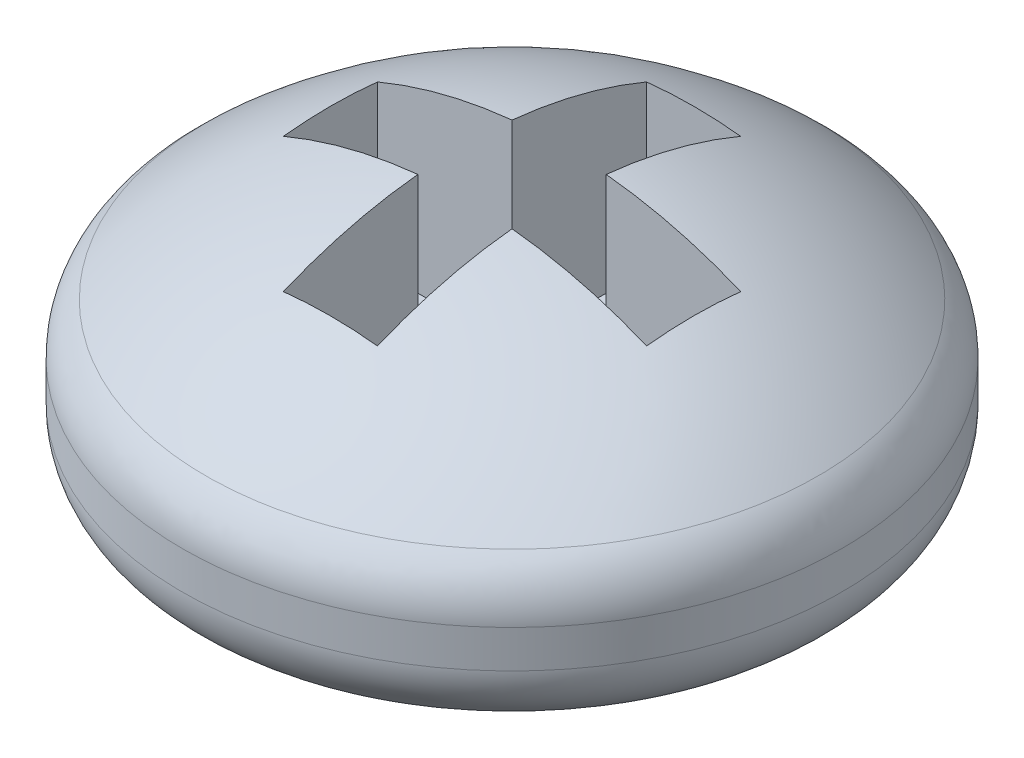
ISO-10303-21;
HEADER;
FILE_DESCRIPTION(('STEP AP214'),'2;1');
FILE_NAME('part.step','',(''),(''),'','','');
FILE_SCHEMA(('AUTOMOTIVE_DESIGN { 1 0 10303 214 1 1 1 1 }'));
ENDSEC;
DATA;
#1=APPLICATION_CONTEXT('core data for automotive mechanical design processes');
#2=APPLICATION_PROTOCOL_DEFINITION('international standard','automotive_design',2000,#1);
#3=PRODUCT_CONTEXT('',#1,'mechanical');
#4=PRODUCT('Part','Part','',(#3));
#5=PRODUCT_RELATED_PRODUCT_CATEGORY('part','',(#4));
#6=PRODUCT_DEFINITION_FORMATION('','',#4);
#7=PRODUCT_DEFINITION_CONTEXT('part definition',#1,'design');
#8=PRODUCT_DEFINITION('design','',#6,#7);
#9=PRODUCT_DEFINITION_SHAPE('','',#8);
#10=(LENGTH_UNIT() NAMED_UNIT(*) SI_UNIT(.MILLI.,.METRE.));
#11=(NAMED_UNIT(*) PLANE_ANGLE_UNIT() SI_UNIT($,.RADIAN.));
#12=(NAMED_UNIT(*) SI_UNIT($,.STERADIAN.) SOLID_ANGLE_UNIT());
#13=UNCERTAINTY_MEASURE_WITH_UNIT(LENGTH_MEASURE(1.E-05),#10,'distance_accuracy_value','');
#14=(GEOMETRIC_REPRESENTATION_CONTEXT(3) GLOBAL_UNCERTAINTY_ASSIGNED_CONTEXT((#13)) GLOBAL_UNIT_ASSIGNED_CONTEXT((#10,
#11,#12)) REPRESENTATION_CONTEXT('',''));
#15=CARTESIAN_POINT('',(0.,0.,0.));
#16=DIRECTION('',(0.,0.,1.));
#17=DIRECTION('',(1.,0.,0.));
#18=AXIS2_PLACEMENT_3D('',#15,#16,#17);
#19=CARTESIAN_POINT('',(0.,60.72875,0.));
#20=DIRECTION('',(-1.,0.,0.));
#21=DIRECTION('',(0.,0.,-1.));
#22=AXIS2_PLACEMENT_3D('',#19,#20,#21);
#23=SPHERICAL_SURFACE('',#22,3.50125);
#24=CARTESIAN_POINT('',(0.257438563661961,63.0101972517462,-2.4364370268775));
#25=CARTESIAN_POINT('',(0.257438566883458,63.2405882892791,-2.43643702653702));
#26=CARTESIAN_POINT('',(0.239035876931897,63.3902800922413,-2.26227119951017));
#27=CARTESIAN_POINT('',(0.120442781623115,63.0101972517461,-2.45091226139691));
#28=CARTESIAN_POINT('',(0.120442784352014,63.2405882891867,-2.45091226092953));
#29=CARTESIAN_POINT('',(0.111833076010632,63.3902800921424,-2.27571168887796));
#30=CARTESIAN_POINT('',(-0.0177767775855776,63.0101972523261,-2.45380548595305));
#31=CARTESIAN_POINT('',(-0.0177767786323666,63.2405882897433,-2.45380548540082));
#32=CARTESIAN_POINT('',(-0.0165060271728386,63.3902800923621,-2.27839809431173));
#33=CARTESIAN_POINT('',(-0.292739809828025,63.0101972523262,-2.43634578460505));
#34=CARTESIAN_POINT('',(-0.292739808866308,63.2405882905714,-2.43634578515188));
#35=CARTESIAN_POINT('',(-0.271813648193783,63.3902800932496,-2.26218647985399));
#36=CARTESIAN_POINT('',(-0.429483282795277,63.0101972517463,-2.4159928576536));
#37=CARTESIAN_POINT('',(-0.429483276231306,63.2405882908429,-2.41599285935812));
#38=CARTESIAN_POINT('',(-0.398782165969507,63.3902800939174,-2.24328845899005));
#39=CARTESIAN_POINT('',(-0.697612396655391,63.0101972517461,-2.35261860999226));
#40=CARTESIAN_POINT('',(-0.697612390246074,63.2405882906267,-2.35261861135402));
#41=CARTESIAN_POINT('',(-0.64774438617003,63.3902800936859,-2.18444444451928));
#42=CARTESIAN_POINT('',(-0.828998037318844,63.0101972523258,-2.30959728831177));
#43=CARTESIAN_POINT('',(-0.828998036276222,63.2405882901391,-2.30959728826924));
#44=CARTESIAN_POINT('',(-0.769738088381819,63.3902800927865,-2.14449845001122));
#45=CARTESIAN_POINT('',(-1.08268181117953,63.0101972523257,-2.20210750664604));
#46=CARTESIAN_POINT('',(-1.08268181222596,63.2405882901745,-2.20210750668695));
#47=CARTESIAN_POINT('',(-1.00528758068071,63.3902800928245,-2.04469244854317));
#48=CARTESIAN_POINT('',(-1.2049799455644,63.0101972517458,-2.13763904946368));
#49=CARTESIAN_POINT('',(-1.20497994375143,63.2405882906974,-2.13763905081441));
#50=CARTESIAN_POINT('',(-1.11884337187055,63.3902800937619,-1.98483244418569));
#51=CARTESIAN_POINT('',(-1.43701702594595,63.0101972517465,-1.98908507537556));
#52=CARTESIAN_POINT('',(-1.43701702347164,63.2405882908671,-1.98908507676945));
#53=CARTESIAN_POINT('',(-1.33429355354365,63.3902800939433,-1.84689767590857));
#54=CARTESIAN_POINT('',(-1.54675597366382,63.0101972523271,-1.90499956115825));
#55=CARTESIAN_POINT('',(-1.5467559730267,63.2405882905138,-1.90499956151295));
#56=CARTESIAN_POINT('',(-1.43618794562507,63.3902800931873,-1.76882291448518));
#57=CARTESIAN_POINT('',(-1.75055957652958,63.0101972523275,-1.71959836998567));
#58=CARTESIAN_POINT('',(-1.75055957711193,63.240588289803,-1.71959836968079));
#59=CARTESIAN_POINT('',(-1.62542289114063,63.3902800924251,-1.59667490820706));
#60=CARTESIAN_POINT('',(-1.84462422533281,63.0101972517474,-1.61828268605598));
#61=CARTESIAN_POINT('',(-1.84462422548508,63.2405882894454,-1.61828268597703));
#62=CARTESIAN_POINT('',(-1.71276343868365,63.3902800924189,-1.50260165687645));
#63=CARTESIAN_POINT('',(-2.01440898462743,63.010197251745,-1.40129719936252));
#64=CARTESIAN_POINT('',(-2.01440898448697,63.2405882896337,-1.40129719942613));
#65=CARTESIAN_POINT('',(-1.87041133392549,63.3902800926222,-1.30112712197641));
#66=CARTESIAN_POINT('',(-2.09012908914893,63.0101972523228,-1.28562739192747));
#67=CARTESIAN_POINT('',(-2.09012908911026,63.2405882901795,-1.28562739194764));
#68=CARTESIAN_POINT('',(-1.94071867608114,63.3902800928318,-1.1937258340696));
#69=CARTESIAN_POINT('',(-2.22107517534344,63.0101972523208,-1.04321734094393));
#70=CARTESIAN_POINT('',(-2.22107517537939,63.2405882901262,-1.04321734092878));
#71=CARTESIAN_POINT('',(-2.06230423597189,63.390280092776,-0.968644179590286));
#72=CARTESIAN_POINT('',(-2.27630117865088,63.0101972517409,-0.916477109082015));
#73=CARTESIAN_POINT('',(-2.27630117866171,63.2405882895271,-0.916477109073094));
#74=CARTESIAN_POINT('',(-2.1135824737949,63.3902800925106,-0.850963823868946));
#75=CARTESIAN_POINT('',(-2.36469146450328,63.0101972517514,-0.655523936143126));
#76=CARTESIAN_POINT('',(-2.36469146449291,63.2405882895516,-0.655523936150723));
#77=CARTESIAN_POINT('',(-2.19565428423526,63.39028009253,-0.608664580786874));
#78=CARTESIAN_POINT('',(-2.3978557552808,63.0101972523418,-0.521310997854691));
#79=CARTESIAN_POINT('',(-2.39785575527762,63.2405882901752,-0.521310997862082));
#80=CARTESIAN_POINT('',(-2.22644786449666,63.3902800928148,-0.484045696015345));
#81=CARTESIAN_POINT('',(-2.441181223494,63.010197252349,-0.249222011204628));
#82=CARTESIAN_POINT('',(-2.44118122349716,63.2405882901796,-0.249222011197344));
#83=CARTESIAN_POINT('',(-2.26667626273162,63.3902800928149,-0.231406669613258));
#84=CARTESIAN_POINT('',(-2.45134235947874,63.0101972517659,-0.111345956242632));
#85=CARTESIAN_POINT('',(-2.4513423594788,63.2405882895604,-0.111345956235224));
#86=CARTESIAN_POINT('',(-2.2761110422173,63.3902800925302,-0.103386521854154));
#87=CARTESIAN_POINT('',(-2.44837306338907,63.0101972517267,0.164154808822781));
#88=CARTESIAN_POINT('',(-2.44837306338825,63.2405882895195,0.164154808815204));
#89=CARTESIAN_POINT('',(-2.27335400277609,63.3902800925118,0.152420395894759));
#90=CARTESIAN_POINT('',(-2.43524267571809,63.0101972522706,0.301779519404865));
#91=CARTESIAN_POINT('',(-2.43524267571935,63.2405882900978,0.30177951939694));
#92=CARTESIAN_POINT('',(-2.26116222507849,63.3902800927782,0.280207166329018));
#93=CARTESIAN_POINT('',(-2.38606269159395,63.0101972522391,0.572871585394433));
#94=CARTESIAN_POINT('',(-2.38606269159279,63.2405882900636,0.572871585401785));
#95=CARTESIAN_POINT('',(-2.21549781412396,63.3902800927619,0.531920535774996));
#96=CARTESIAN_POINT('',(-2.35001304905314,63.0101972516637,0.706338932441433));
#97=CARTESIAN_POINT('',(-2.3500130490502,63.2405882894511,0.706338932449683));
#98=CARTESIAN_POINT('',(-2.18202513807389,63.3902800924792,0.655847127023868));
#99=CARTESIAN_POINT('',(-2.25601851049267,63.0101972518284,0.965328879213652));
#100=CARTESIAN_POINT('',(-2.25601851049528,63.2405882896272,0.965328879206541));
#101=CARTESIAN_POINT('',(-2.09474968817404,63.390280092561,0.896323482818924));
#102=CARTESIAN_POINT('',(-2.19807320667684,63.0101972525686,1.09085133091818));
#103=CARTESIAN_POINT('',(-2.19807320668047,63.2405882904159,1.09085133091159));
#104=CARTESIAN_POINT('',(-2.04094653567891,63.3902800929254,1.01287310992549));
#105=CARTESIAN_POINT('',(-2.06192931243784,63.0101972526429,1.33038358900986));
#106=CARTESIAN_POINT('',(-2.06192931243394,63.2405882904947,1.33038358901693));
#107=CARTESIAN_POINT('',(-1.9145347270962,63.3902800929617,1.23528268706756));
#108=CARTESIAN_POINT('',(-1.98373151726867,63.0101972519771,1.44439384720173));
#109=CARTESIAN_POINT('',(-1.9837315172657,63.240588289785,1.44439384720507));
#110=CARTESIAN_POINT('',(-1.84192680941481,63.3902800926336,1.34114305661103));
#111=CARTESIAN_POINT('',(-1.8093201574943,63.0101972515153,1.65766337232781));
#112=CARTESIAN_POINT('',(-1.8093201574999,63.2405882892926,1.65766337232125));
#113=CARTESIAN_POINT('',(-1.67998304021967,63.3902800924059,1.53916726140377));
#114=CARTESIAN_POINT('',(-1.71310606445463,63.0101972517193,1.75692220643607));
#115=CARTESIAN_POINT('',(-1.71310606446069,63.24058828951,1.75692220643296));
#116=CARTESIAN_POINT('',(-1.59064669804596,63.3902800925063,1.63133069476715));
#117=CARTESIAN_POINT('',(-1.50531681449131,63.010197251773,1.93790582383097));
#118=CARTESIAN_POINT('',(-1.50531681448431,63.2405882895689,1.9379058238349));
#119=CARTESIAN_POINT('',(-1.39771101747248,63.3902800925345,1.79937691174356));
#120=CARTESIAN_POINT('',(-1.39374195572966,63.0101972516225,2.01963094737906));
#121=CARTESIAN_POINT('',(-1.39374195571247,63.2405882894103,2.01963094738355));
#122=CARTESIAN_POINT('',(-1.29411195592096,63.3902800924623,1.87526001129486));
#123=CARTESIAN_POINT('',(-1.21734318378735,63.0101972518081,2.12728656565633));
#124=CARTESIAN_POINT('',(-1.21734318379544,63.240588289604,2.12728656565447));
#125=CARTESIAN_POINT('',(-1.13032284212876,63.3902800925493,1.97521999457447));
#126=CARTESIAN_POINT('',(-1.1569745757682,63.0101972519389,2.16070823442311));
#127=CARTESIAN_POINT('',(-1.15697457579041,63.2405882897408,2.16070823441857));
#128=CARTESIAN_POINT('',(-1.0742696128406,63.390280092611,2.00625255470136));
#129=CARTESIAN_POINT('',(-1.03369718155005,63.0101972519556,2.22232236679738));
#130=CARTESIAN_POINT('',(-1.03369718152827,63.2405882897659,2.2223223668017));
#131=CARTESIAN_POINT('',(-0.959804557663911,63.3902800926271,2.06346227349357));
#132=CARTESIAN_POINT('',(-0.970790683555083,63.0101972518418,2.25051941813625));
#133=CARTESIAN_POINT('',(-0.970790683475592,63.2405882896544,2.25051941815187));
#134=CARTESIAN_POINT('',(-0.901394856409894,63.3902800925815,2.08964369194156));
#135=CARTESIAN_POINT('',(-0.778924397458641,63.0101972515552,2.326943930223));
#136=CARTESIAN_POINT('',(-0.778924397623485,63.2405882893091,2.32694393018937));
#137=CARTESIAN_POINT('',(-0.723243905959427,63.3902800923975,2.16060508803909));
#138=CARTESIAN_POINT('',(-0.646621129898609,63.0101972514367,2.36712454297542));
#139=CARTESIAN_POINT('',(-0.646621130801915,63.2405882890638,2.36712454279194));
#140=CARTESIAN_POINT('',(-0.600398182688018,63.3902800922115,2.19791343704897));
#141=CARTESIAN_POINT('',(-0.427918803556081,63.0101972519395,2.41387898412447));
#142=CARTESIAN_POINT('',(-0.427918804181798,63.2405882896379,2.41387898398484));
#143=CARTESIAN_POINT('',(-0.39732953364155,63.3902800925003,2.24132569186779));
#144=CARTESIAN_POINT('',(-0.342916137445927,63.0101972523,2.42740530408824));
#145=CARTESIAN_POINT('',(-0.3429161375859,63.2405882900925,2.4274053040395));
#146=CARTESIAN_POINT('',(-0.318403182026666,63.3902800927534,2.25388509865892));
#147=CARTESIAN_POINT('',(-0.171960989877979,63.0101972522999,2.44546874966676));
#148=CARTESIAN_POINT('',(-0.171960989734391,63.2405882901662,2.44546874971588));
#149=CARTESIAN_POINT('',(-0.159668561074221,63.3902800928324,2.27065730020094));
#150=CARTESIAN_POINT('',(-0.0860085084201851,63.0101972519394,2.45000587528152));
#151=CARTESIAN_POINT('',(-0.0860085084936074,63.2405882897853,2.45000587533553));
#152=CARTESIAN_POINT('',(-0.0798602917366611,63.3902800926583,2.27487009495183));
#153=CARTESIAN_POINT('',(0.137635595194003,63.0101972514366,2.44999059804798));
#154=CARTESIAN_POINT('',(0.137635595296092,63.2405882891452,2.44999059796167));
#155=CARTESIAN_POINT('',(0.127796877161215,63.3902800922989,2.27485590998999));
#156=CARTESIAN_POINT('',(0.275414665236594,63.0101972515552,2.43834739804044));
#157=CARTESIAN_POINT('',(0.275414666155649,63.2405882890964,2.43834739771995));
#158=CARTESIAN_POINT('',(0.255726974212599,63.3902800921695,2.26404501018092));
#159=CARTESIAN_POINT('',(0.47901609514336,63.0101972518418,2.4037087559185));
#160=CARTESIAN_POINT('',(0.479016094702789,63.240588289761,2.40370875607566));
#161=CARTESIAN_POINT('',(0.444774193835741,63.3902800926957,2.23188247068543));
#162=CARTESIAN_POINT('',(0.546426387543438,63.0101972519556,2.38928122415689));
#163=CARTESIAN_POINT('',(0.546426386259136,63.2405882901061,2.38928122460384));
#164=CARTESIAN_POINT('',(0.507365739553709,63.3902800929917,2.21848627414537));
#165=CARTESIAN_POINT('',(0.679858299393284,63.0101972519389,2.35479148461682));
#166=CARTESIAN_POINT('',(0.679858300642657,63.2405882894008,2.35479148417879));
#167=CARTESIAN_POINT('',(0.63125943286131,63.3902800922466,2.18646199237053));
#168=CARTESIAN_POINT('',(0.745878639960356,63.0101972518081,2.33472431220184));
#169=CARTESIAN_POINT('',(0.745878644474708,63.2405882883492,2.33472431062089));
#170=CARTESIAN_POINT('',(0.692560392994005,63.3902800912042,2.16782929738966));
#171=CARTESIAN_POINT('',(0.94088112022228,63.0101972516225,2.26631165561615));
#172=CARTESIAN_POINT('',(0.940881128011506,63.2405882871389,2.26631165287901));
#173=CARTESIAN_POINT('',(0.873623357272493,63.3902800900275,2.10430703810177));
#174=CARTESIAN_POINT('',(1.06707192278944,63.010197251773,2.20970930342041));
#175=CARTESIAN_POINT('',(1.06707192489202,63.2405882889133,2.20970930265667));
#176=CARTESIAN_POINT('',(0.990793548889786,63.3902800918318,2.05175083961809));
#177=CARTESIAN_POINT('',(1.30809656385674,63.0101972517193,2.07614821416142));
#178=CARTESIAN_POINT('',(1.30809656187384,63.2405882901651,2.07614821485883));
#179=CARTESIAN_POINT('',(1.21458881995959,63.3902800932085,1.9277372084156));
#180=CARTESIAN_POINT('',(1.42293018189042,63.0101972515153,1.99918908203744));
#181=CARTESIAN_POINT('',(1.42293018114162,63.2405882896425,1.99918908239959));
#182=CARTESIAN_POINT('',(1.32121369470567,63.3902800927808,1.85627940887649));
#183=CARTESIAN_POINT('',(1.6380614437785,63.0101972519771,1.82707937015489));
#184=CARTESIAN_POINT('',(1.6380614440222,63.2405882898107,1.82707937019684));
#185=CARTESIAN_POINT('',(1.52096655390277,63.3902800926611,1.69647275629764));
#186=CARTESIAN_POINT('',(1.73835951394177,63.0101972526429,1.73192932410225));
#187=CARTESIAN_POINT('',(1.73835951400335,63.2405882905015,1.73192932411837));
#188=CARTESIAN_POINT('',(1.61409493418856,63.390280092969,1.60812439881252));
#189=CARTESIAN_POINT('',(1.92155700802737,63.0101972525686,1.52613928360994));
#190=CARTESIAN_POINT('',(1.92155700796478,63.2405882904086,1.52613928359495));
#191=CARTESIAN_POINT('',(1.78419677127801,63.3902800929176,1.41704501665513));
#192=CARTESIAN_POINT('',(2.00445574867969,63.0101972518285,1.41549868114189));
#193=CARTESIAN_POINT('',(2.00445574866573,63.2405882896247,1.41549868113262));
#194=CARTESIAN_POINT('',(1.86116959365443,63.3902800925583,1.31431342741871));
#195=CARTESIAN_POINT('',(2.15050111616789,63.0101972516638,1.18187180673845));
#196=CARTESIAN_POINT('',(2.15050111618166,63.240588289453,1.18187180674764));
#197=CARTESIAN_POINT('',(1.99677508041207,63.3902800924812,1.09738709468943));
#198=CARTESIAN_POINT('',(2.21364811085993,63.0101972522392,1.05888576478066));
#199=CARTESIAN_POINT('',(2.21364811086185,63.240588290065,1.05888576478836));
#200=CARTESIAN_POINT('',(2.05540808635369,63.3902800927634,0.983192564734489));
#201=CARTESIAN_POINT('',(2.31839776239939,63.0101972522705,0.804058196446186));
#202=CARTESIAN_POINT('',(2.31839776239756,63.2405882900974,0.804058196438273));
#203=CARTESIAN_POINT('',(2.15266983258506,63.3902800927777,0.746581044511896));
#204=CARTESIAN_POINT('',(2.36000046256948,63.0101972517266,0.67221668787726));
#205=CARTESIAN_POINT('',(2.36000046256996,63.2405882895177,0.672216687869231));
#206=CARTESIAN_POINT('',(2.19129861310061,63.3902800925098,0.624164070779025));
#207=CARTESIAN_POINT('',(2.4204812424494,63.0101972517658,0.403420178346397));
#208=CARTESIAN_POINT('',(2.42048124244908,63.2405882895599,0.403420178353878));
#209=CARTESIAN_POINT('',(2.24745599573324,63.3902800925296,0.374582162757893));
#210=CARTESIAN_POINT('',(2.43935927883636,63.010197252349,0.266465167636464));
#211=CARTESIAN_POINT('',(2.4393592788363,63.2405882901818,0.266465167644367));
#212=CARTESIAN_POINT('',(2.26498455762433,63.3902800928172,0.247417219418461));
#213=CARTESIAN_POINT('',(2.45385456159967,63.0101972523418,-0.0086700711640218));
#214=CARTESIAN_POINT('',(2.45385456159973,63.2405882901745,-0.00867007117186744));
#215=CARTESIAN_POINT('',(2.27844366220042,63.390280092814,-0.00805030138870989));
#216=CARTESIAN_POINT('',(2.44947184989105,63.0101972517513,-0.146850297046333));
#217=CARTESIAN_POINT('',(2.44947184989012,63.2405882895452,-0.146850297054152));
#218=CARTESIAN_POINT('',(2.27437424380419,63.3902800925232,-0.13635287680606));
#219=CARTESIAN_POINT('',(2.41757017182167,63.0101972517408,-0.420513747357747));
#220=CARTESIAN_POINT('',(2.4175701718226,63.2405882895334,-0.420513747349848));
#221=CARTESIAN_POINT('',(2.24475301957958,63.3902800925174,-0.390453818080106));
#222=CARTESIAN_POINT('',(2.39005119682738,63.0101972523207,-0.555996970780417));
#223=CARTESIAN_POINT('',(2.39005119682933,63.2405882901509,-0.555996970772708));
#224=CARTESIAN_POINT('',(2.21920120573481,63.3902800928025,-0.516252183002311));
#225=CARTESIAN_POINT('',(2.31265811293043,63.0101972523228,-0.820420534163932));
#226=CARTESIAN_POINT('',(2.31265811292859,63.2405882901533,-0.820420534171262));
#227=CARTESIAN_POINT('',(2.14734047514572,63.3902800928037,-0.761773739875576));
#228=CARTESIAN_POINT('',(2.26278398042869,63.0101972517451,-0.949360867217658));
#229=CARTESIAN_POINT('',(2.26278398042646,63.2405882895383,-0.949360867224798));
#230=CARTESIAN_POINT('',(2.10103153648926,63.3902800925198,-0.881496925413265));
#231=CARTESIAN_POINT('',(2.14209637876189,63.0101972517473,-1.19703821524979));
#232=CARTESIAN_POINT('',(2.14209637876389,63.2405882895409,-1.19703821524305));
#233=CARTESIAN_POINT('',(1.98897114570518,63.3902800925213,-1.11146935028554));
#234=CARTESIAN_POINT('',(2.07128291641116,63.0101972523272,-1.31577523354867));
#235=CARTESIAN_POINT('',(2.07128291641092,63.2405882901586,-1.31577523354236));
#236=CARTESIAN_POINT('',(1.92321969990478,63.3902800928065,-1.22171859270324));
#237=CARTESIAN_POINT('',(1.9107268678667,63.0101972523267,-1.53967535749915));
#238=CARTESIAN_POINT('',(1.9107268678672,63.2405882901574,-1.5396753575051));
#239=CARTESIAN_POINT('',(1.77414081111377,63.3902800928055,-1.4296134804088));
#240=CARTESIAN_POINT('',(1.82098428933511,63.0101972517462,-1.64483846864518));
#241=CARTESIAN_POINT('',(1.82098428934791,63.2405882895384,-1.64483846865));
#242=CARTESIAN_POINT('',(1.69081337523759,63.3902800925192,-1.52725913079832));
#243=CARTESIAN_POINT('',(1.62511750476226,63.0101972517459,-1.83860557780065));
#244=CARTESIAN_POINT('',(1.62511750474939,63.2405882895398,-1.83860557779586));
#245=CARTESIAN_POINT('',(1.50894789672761,63.390280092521,-1.70717502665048));
#246=CARTESIAN_POINT('',(1.51899329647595,63.010197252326,-1.9272095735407));
#247=CARTESIAN_POINT('',(1.51899329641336,63.2405882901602,-1.92720957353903));
#248=CARTESIAN_POINT('',(1.41040985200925,63.390280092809,-1.78944527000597));
#249=CARTESIAN_POINT('',(1.29337580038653,63.0101972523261,-2.08534323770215));
#250=CARTESIAN_POINT('',(1.29337580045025,63.2405882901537,-2.08534323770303));
#251=CARTESIAN_POINT('',(1.20092035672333,63.3902800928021,-1.93627493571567));
#252=CARTESIAN_POINT('',(1.17388251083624,63.010197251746,-2.15487290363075));
#253=CARTESIAN_POINT('',(1.17388251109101,63.2405882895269,-2.1548729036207));
#254=CARTESIAN_POINT('',(1.0899689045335,63.390280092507,-2.00083435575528));
#255=CARTESIAN_POINT('',(0.92491893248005,63.0101972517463,-2.27288414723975));
#256=CARTESIAN_POINT('',(0.924918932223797,63.2405882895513,-2.27288414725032));
#257=CARTESIAN_POINT('',(0.858802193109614,63.3902800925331,-2.11040970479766));
#258=CARTESIAN_POINT('',(0.795448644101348,63.0101972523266,-2.32136572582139));
#259=CARTESIAN_POINT('',(0.795448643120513,63.2405882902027,-2.32136572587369));
#260=CARTESIAN_POINT('',(0.738586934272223,63.3902800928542,-2.15542563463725));
#261=CARTESIAN_POINT('',(0.530206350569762,63.0101972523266,-2.39590454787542));
#262=CARTESIAN_POINT('',(0.530206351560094,63.2405882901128,-2.39590454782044));
#263=CARTESIAN_POINT('',(0.49230517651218,63.3902800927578,-2.22463613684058));
#264=CARTESIAN_POINT('',(0.394434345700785,63.0101972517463,-2.42196179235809));
#265=CARTESIAN_POINT('',(0.394434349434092,63.2405882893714,-2.42196179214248));
#266=CARTESIAN_POINT('',(0.366238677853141,63.3902800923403,-2.24883071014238));
#267=CARTESIAN_POINT('',(0.257438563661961,63.0101972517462,-2.4364370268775));
#268=CARTESIAN_POINT('',(0.257438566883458,63.2405882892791,-2.43643702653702));
#269=CARTESIAN_POINT('',(0.239035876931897,63.3902800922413,-2.26227119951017));
#270=(BOUNDED_SURFACE() B_SPLINE_SURFACE(3,2,((#24,#25,#26),(#27,#28,#29),(#30,#31,#32),(#33,
#34,#35),(#36,#37,#38),(#39,#40,#41),(#42,#43,#44),(#45,#46,#47),(#48,#49,#50),(#51,#52,#53),
(#54,#55,#56),(#57,#58,#59),(#60,#61,#62),(#63,#64,#65),(#66,#67,#68),(#69,#70,#71),(#72,#73,
#74),(#75,#76,#77),(#78,#79,#80),(#81,#82,#83),(#84,#85,#86),(#87,#88,#89),(#90,#91,#92),(#93,
#94,#95),(#96,#97,#98),(#99,#100,#101),(#102,#103,#104),(#105,#106,#107),(#108,#109,#110),(#111,
#112,#113),(#114,#115,#116),(#117,#118,#119),(#120,#121,#122),(#123,#124,#125),(#126,#127,#128),
(#129,#130,#131),(#132,#133,#134),(#135,#136,#137),(#138,#139,#140),(#141,#142,#143),(#144,#145,
#146),(#147,#148,#149),(#150,#151,#152),(#153,#154,#155),(#156,#157,#158),(#159,#160,#161),
(#162,#163,#164),(#165,#166,#167),(#168,#169,#170),(#171,#172,#173),(#174,#175,#176),(#177,#178,
#179),(#180,#181,#182),(#183,#184,#185),(#186,#187,#188),(#189,#190,#191),(#192,#193,#194),
(#195,#196,#197),(#198,#199,#200),(#201,#202,#203),(#204,#205,#206),(#207,#208,#209),(#210,#211,
#212),(#213,#214,#215),(#216,#217,#218),(#219,#220,#221),(#222,#223,#224),(#225,#226,#227),
(#228,#229,#230),(#231,#232,#233),(#234,#235,#236),(#237,#238,#239),(#240,#241,#242),(#243,#244,
#245),(#246,#247,#248),(#249,#250,#251),(#252,#253,#254),(#255,#256,#257),(#258,#259,#260),
(#261,#262,#263),(#264,#265,#266),(#267,#268,#269)),.UNSPECIFIED.,.T.,.F.,
.F.) B_SPLINE_SURFACE_WITH_KNOTS((4,2,2,2,2,2,2,2,2,2,2,2,2,2,2,2,2,2,2,2,2,2,2,2,2,2,2,2,2,2,2,
2,2,2,2,2,2,2,2,2,4),(3,3),(0.,0.328544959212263,0.657089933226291,0.985634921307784,
1.31417986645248,1.64272476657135,1.97126979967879,2.29981493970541,2.62835973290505,
2.95690440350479,3.28544966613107,3.61399430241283,3.94253959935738,4.27109101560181,
4.59962953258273,4.92817768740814,5.2567194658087,5.42130986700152,5.58575504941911,
5.91410228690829,6.11928653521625,6.32447078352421,6.65281802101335,6.81726320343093,
6.98185360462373,7.31039538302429,7.63894353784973,7.96748205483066,8.29603347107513,
8.62457876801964,8.95312340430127,9.28166866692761,9.61021333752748,9.93875813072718,
10.2673032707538,10.5958483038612,10.92439320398,11.2529381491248,11.5814831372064,
11.9100281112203,12.2385730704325),(0.,1.),
.UNSPECIFIED.) GEOMETRIC_REPRESENTATION_ITEM() RATIONAL_B_SPLINE_SURFACE(((1.,0.908220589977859,
1.),(1.,0.90822059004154,1.),(1.,0.908220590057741,1.),(1.,0.908220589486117,1.),(1.,
0.908220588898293,1.),(1.,0.908220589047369,1.),(1.,0.908220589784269,1.),(1.,0.908220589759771,
1.),(1.,0.908220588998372,1.),(1.,0.908220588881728,1.),(1.,0.908220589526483,1.),(1.,
0.908220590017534,1.),(1.,0.908220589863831,1.),(1.,0.908220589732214,1.),(1.,0.908220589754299,
1.),(1.,0.908220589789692,1.),(1.,0.908220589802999,1.),(1.,0.90822058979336,1.),(1.,
0.908220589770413,1.),(1.,0.908220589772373,1.),(1.,0.908220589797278,1.),(1.,0.908220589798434,
1.),(1.,0.908220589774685,1.),(1.,0.90822058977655,1.),(1.,0.908220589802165,1.),(1.,
0.90822058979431,1.),(1.,0.908220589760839,1.),(1.,0.908220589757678,1.),(1.,0.908220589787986,
1.),(1.,0.908220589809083,1.),(1.,0.908220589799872,1.),(1.,0.90822058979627,1.),(1.,
0.908220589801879,1.),(1.,0.908220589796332,1.),(1.,0.908220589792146,1.),(1.,0.908220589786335,
1.),(1.,0.908220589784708,1.),(1.,0.908220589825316,1.),(1.,0.908220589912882,1.),(1.,
0.908220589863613,1.),(1.,0.90822058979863,1.),(1.,0.908220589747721,1.),(1.,0.908220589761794,
1.),(1.,0.908220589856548,1.),(1.,0.908220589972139,1.),(1.,0.908220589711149,1.),(1.,
0.908220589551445,1.),(1.,0.908220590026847,1.),(1.,0.908220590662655,1.),(1.,0.908220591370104,
1.),(1.,0.90822059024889,1.),(1.,0.908220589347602,1.),(1.,0.908220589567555,1.),(1.,
0.908220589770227,1.),(1.,0.908220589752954,1.),(1.,0.908220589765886,1.),(1.,0.908220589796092,
1.),(1.,0.908220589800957,1.),(1.,0.908220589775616,1.),(1.,0.908220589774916,1.),(1.,
0.908220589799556,1.),(1.,0.908220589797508,1.),(1.,0.908220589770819,1.),(1.,0.908220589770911,
1.),(1.,0.908220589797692,1.),(1.,0.908220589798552,1.),(1.,0.90822058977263,1.),(1.,
0.908220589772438,1.),(1.,0.908220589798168,1.),(1.,0.908220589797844,1.),(1.,0.90822058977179,
1.),(1.,0.90822058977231,1.),(1.,0.908220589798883,1.),(1.,0.908220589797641,1.),(1.,
0.908220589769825,1.),(1.,0.908220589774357,1.),(1.,0.908220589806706,1.),(1.,0.908220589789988,
1.),(1.,0.908220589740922,1.),(1.,0.908220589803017,1.),(1.,0.908220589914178,1.),(1.,
0.908220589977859,1.))) REPRESENTATION_ITEM('') SURFACE());
#271=CARTESIAN_POINT('',(0.239035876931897,63.3902800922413,-2.26227119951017));
#272=CARTESIAN_POINT('',(0.111833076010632,63.3902800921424,-2.27571168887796));
#273=CARTESIAN_POINT('',(-0.0165060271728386,63.3902800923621,-2.27839809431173));
#274=CARTESIAN_POINT('',(-0.271813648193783,63.3902800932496,-2.26218647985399));
#275=CARTESIAN_POINT('',(-0.398782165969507,63.3902800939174,-2.24328845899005));
#276=CARTESIAN_POINT('',(-0.64774438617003,63.3902800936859,-2.18444444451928));
#277=CARTESIAN_POINT('',(-0.769738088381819,63.3902800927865,-2.14449845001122));
#278=CARTESIAN_POINT('',(-1.00528758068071,63.3902800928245,-2.04469244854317));
#279=CARTESIAN_POINT('',(-1.11884337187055,63.3902800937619,-1.98483244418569));
#280=CARTESIAN_POINT('',(-1.33429355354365,63.3902800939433,-1.84689767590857));
#281=CARTESIAN_POINT('',(-1.43618794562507,63.3902800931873,-1.76882291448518));
#282=CARTESIAN_POINT('',(-1.62542289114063,63.3902800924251,-1.59667490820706));
#283=CARTESIAN_POINT('',(-1.71276343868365,63.3902800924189,-1.50260165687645));
#284=CARTESIAN_POINT('',(-1.87041133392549,63.3902800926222,-1.30112712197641));
#285=CARTESIAN_POINT('',(-1.94071867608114,63.3902800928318,-1.1937258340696));
#286=CARTESIAN_POINT('',(-2.06230423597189,63.390280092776,-0.968644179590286));
#287=CARTESIAN_POINT('',(-2.1135824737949,63.3902800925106,-0.850963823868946));
#288=CARTESIAN_POINT('',(-2.19565428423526,63.39028009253,-0.608664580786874));
#289=CARTESIAN_POINT('',(-2.22644786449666,63.3902800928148,-0.484045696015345));
#290=CARTESIAN_POINT('',(-2.26667626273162,63.3902800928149,-0.231406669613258));
#291=CARTESIAN_POINT('',(-2.2761110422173,63.3902800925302,-0.103386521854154));
#292=CARTESIAN_POINT('',(-2.27335400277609,63.3902800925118,0.152420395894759));
#293=CARTESIAN_POINT('',(-2.26116222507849,63.3902800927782,0.280207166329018));
#294=CARTESIAN_POINT('',(-2.21549781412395,63.3902800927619,0.531920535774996));
#295=CARTESIAN_POINT('',(-2.18202513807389,63.3902800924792,0.655847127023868));
#296=CARTESIAN_POINT('',(-2.09474968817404,63.390280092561,0.896323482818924));
#297=CARTESIAN_POINT('',(-2.04094653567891,63.3902800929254,1.01287310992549));
#298=CARTESIAN_POINT('',(-1.9145347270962,63.3902800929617,1.23528268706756));
#299=CARTESIAN_POINT('',(-1.84192680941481,63.3902800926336,1.34114305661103));
#300=CARTESIAN_POINT('',(-1.67998304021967,63.3902800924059,1.53916726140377));
#301=CARTESIAN_POINT('',(-1.59064669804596,63.3902800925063,1.63133069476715));
#302=CARTESIAN_POINT('',(-1.39771101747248,63.3902800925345,1.79937691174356));
#303=CARTESIAN_POINT('',(-1.29411195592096,63.3902800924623,1.87526001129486));
#304=CARTESIAN_POINT('',(-1.13032284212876,63.3902800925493,1.97521999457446));
#305=CARTESIAN_POINT('',(-1.0742696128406,63.390280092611,2.00625255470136));
#306=CARTESIAN_POINT('',(-0.959804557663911,63.3902800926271,2.06346227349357));
#307=CARTESIAN_POINT('',(-0.901394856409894,63.3902800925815,2.08964369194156));
#308=CARTESIAN_POINT('',(-0.723243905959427,63.3902800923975,2.16060508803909));
#309=CARTESIAN_POINT('',(-0.600398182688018,63.3902800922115,2.19791343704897));
#310=CARTESIAN_POINT('',(-0.39732953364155,63.3902800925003,2.24132569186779));
#311=CARTESIAN_POINT('',(-0.318403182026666,63.3902800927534,2.25388509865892));
#312=CARTESIAN_POINT('',(-0.159668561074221,63.3902800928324,2.27065730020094));
#313=CARTESIAN_POINT('',(-0.079860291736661,63.3902800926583,2.27487009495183));
#314=CARTESIAN_POINT('',(0.127796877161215,63.3902800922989,2.27485590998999));
#315=CARTESIAN_POINT('',(0.255726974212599,63.3902800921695,2.26404501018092));
#316=CARTESIAN_POINT('',(0.444774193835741,63.3902800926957,2.23188247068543));
#317=CARTESIAN_POINT('',(0.507365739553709,63.3902800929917,2.21848627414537));
#318=CARTESIAN_POINT('',(0.63125943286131,63.3902800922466,2.18646199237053));
#319=CARTESIAN_POINT('',(0.692560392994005,63.3902800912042,2.16782929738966));
#320=CARTESIAN_POINT('',(0.873623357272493,63.3902800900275,2.10430703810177));
#321=CARTESIAN_POINT('',(0.990793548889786,63.3902800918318,2.05175083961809));
#322=CARTESIAN_POINT('',(1.21458881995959,63.3902800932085,1.9277372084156));
#323=CARTESIAN_POINT('',(1.32121369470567,63.3902800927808,1.85627940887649));
#324=CARTESIAN_POINT('',(1.52096655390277,63.3902800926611,1.69647275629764));
#325=CARTESIAN_POINT('',(1.61409493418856,63.390280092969,1.60812439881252));
#326=CARTESIAN_POINT('',(1.78419677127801,63.3902800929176,1.41704501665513));
#327=CARTESIAN_POINT('',(1.86116959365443,63.3902800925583,1.31431342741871));
#328=CARTESIAN_POINT('',(1.99677508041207,63.3902800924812,1.09738709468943));
#329=CARTESIAN_POINT('',(2.05540808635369,63.3902800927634,0.983192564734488));
#330=CARTESIAN_POINT('',(2.15266983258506,63.3902800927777,0.746581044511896));
#331=CARTESIAN_POINT('',(2.19129861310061,63.3902800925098,0.624164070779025));
#332=CARTESIAN_POINT('',(2.24745599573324,63.3902800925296,0.374582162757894));
#333=CARTESIAN_POINT('',(2.26498455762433,63.3902800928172,0.247417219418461));
#334=CARTESIAN_POINT('',(2.27844366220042,63.390280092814,-0.00805030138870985));
#335=CARTESIAN_POINT('',(2.27437424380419,63.3902800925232,-0.13635287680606));
#336=CARTESIAN_POINT('',(2.24475301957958,63.3902800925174,-0.390453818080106));
#337=CARTESIAN_POINT('',(2.21920120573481,63.3902800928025,-0.516252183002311));
#338=CARTESIAN_POINT('',(2.14734047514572,63.3902800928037,-0.761773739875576));
#339=CARTESIAN_POINT('',(2.10103153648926,63.3902800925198,-0.881496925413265));
#340=CARTESIAN_POINT('',(1.98897114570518,63.3902800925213,-1.11146935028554));
#341=CARTESIAN_POINT('',(1.92321969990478,63.3902800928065,-1.22171859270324));
#342=CARTESIAN_POINT('',(1.77414081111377,63.3902800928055,-1.4296134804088));
#343=CARTESIAN_POINT('',(1.69081337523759,63.3902800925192,-1.52725913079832));
#344=CARTESIAN_POINT('',(1.50894789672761,63.390280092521,-1.70717502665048));
#345=CARTESIAN_POINT('',(1.41040985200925,63.390280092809,-1.78944527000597));
#346=CARTESIAN_POINT('',(1.20092035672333,63.3902800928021,-1.93627493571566));
#347=CARTESIAN_POINT('',(1.0899689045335,63.390280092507,-2.00083435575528));
#348=CARTESIAN_POINT('',(0.858802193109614,63.3902800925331,-2.11040970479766));
#349=CARTESIAN_POINT('',(0.738586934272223,63.3902800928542,-2.15542563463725));
#350=CARTESIAN_POINT('',(0.49230517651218,63.3902800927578,-2.22463613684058));
#351=CARTESIAN_POINT('',(0.366238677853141,63.3902800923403,-2.24883071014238));
#352=CARTESIAN_POINT('',(0.239035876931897,63.3902800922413,-2.26227119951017));
#353=B_SPLINE_CURVE_WITH_KNOTS('',3,(#271,#272,#273,#274,#275,#276,#277,#278,#279,#280,#281,
#282,#283,#284,#285,#286,#287,#288,#289,#290,#291,#292,#293,#294,#295,#296,#297,#298,#299,#300,
#301,#302,#303,#304,#305,#306,#307,#308,#309,#310,#311,#312,#313,#314,#315,#316,#317,#318,#319,
#320,#321,#322,#323,#324,#325,#326,#327,#328,#329,#330,#331,#332,#333,#334,#335,#336,#337,#338,
#339,#340,#341,#342,#343,#344,#345,#346,#347,#348,#349,#350,#351,#352),.UNSPECIFIED.,.T.,.F.,(4,
2,2,2,2,2,2,2,2,2,2,2,2,2,2,2,2,2,2,2,2,2,2,2,2,2,2,2,2,2,2,2,2,2,2,2,2,2,2,2,4),(0.,
0.328544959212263,0.657089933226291,0.985634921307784,1.31417986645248,1.64272476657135,
1.97126979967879,2.29981493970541,2.62835973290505,2.95690440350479,3.28544966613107,
3.61399430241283,3.94253959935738,4.27109101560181,4.59962953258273,4.92817768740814,
5.2567194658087,5.42130986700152,5.58575504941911,5.91410228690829,6.11928653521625,
6.32447078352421,6.65281802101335,6.81726320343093,6.98185360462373,7.31039538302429,
7.63894353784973,7.96748205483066,8.29603347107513,8.62457876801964,8.95312340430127,
9.28166866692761,9.61021333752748,9.93875813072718,10.2673032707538,10.5958483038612,
10.92439320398,11.2529381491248,11.5814831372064,11.9100281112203,12.2385730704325),.UNSPECIFIED.);
#354=CARTESIAN_POINT('',(0.239035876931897,63.3902800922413,-2.26227119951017));
#355=VERTEX_POINT('',#354);
#356=EDGE_CURVE('E13',#355,#355,#353,.T.);
#357=ORIENTED_EDGE('',*,*,#356,.T.);
#358=EDGE_LOOP('',(#357));
#359=FACE_BOUND('',#358,.T.);
#360=CARTESIAN_POINT('',(0.350000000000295,63.9402530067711,1.34999999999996));
#361=CARTESIAN_POINT('',(0.233333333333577,63.9529301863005,1.34999999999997));
#362=CARTESIAN_POINT('',(0.116666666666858,63.9592687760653,1.34999999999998));
#363=CARTESIAN_POINT('',(-0.116666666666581,63.9592687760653,1.35000000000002));
#364=CARTESIAN_POINT('',(-0.233333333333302,63.9529301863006,1.35000000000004));
#365=CARTESIAN_POINT('',(-0.350000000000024,63.9402530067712,1.35000000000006));
#366=B_SPLINE_CURVE_WITH_KNOTS('',3,(#360,#361,#362,#363,#364,#365),.UNSPECIFIED.,.F.,.F.,(4,2,
4),(0.,0.350516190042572,0.701032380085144),.UNSPECIFIED.);
#367=CARTESIAN_POINT('',(0.3500000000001,63.9402530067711,1.35));
#368=VERTEX_POINT('',#367);
#369=CARTESIAN_POINT('',(-0.349999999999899,63.9402530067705,1.35000000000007));
#370=VERTEX_POINT('',#369);
#371=EDGE_CURVE('E155',#368,#370,#366,.T.);
#372=ORIENTED_EDGE('',*,*,#371,.T.);
#373=CARTESIAN_POINT('',(-0.349999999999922,60.72875,0.));
#374=DIRECTION('',(-1.,0.,0.));
#375=DIRECTION('',(0.,0.,1.));
#376=AXIS2_PLACEMENT_3D('',#373,#374,#375);
#377=CIRCLE('',#376,3.48371232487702);
#378=CARTESIAN_POINT('',(-0.349999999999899,64.1948359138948,0.350000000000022));
#379=VERTEX_POINT('',#378);
#380=EDGE_CURVE('E182',#370,#379,#377,.T.);
#381=ORIENTED_EDGE('',*,*,#380,.T.);
#382=CARTESIAN_POINT('',(-0.350000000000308,64.1948359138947,0.349999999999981));
#383=CARTESIAN_POINT('',(-0.393143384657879,64.1904797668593,0.350000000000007));
#384=CARTESIAN_POINT('',(-0.436205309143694,64.1853173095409,0.350000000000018));
#385=CARTESIAN_POINT('',(-0.521929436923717,64.1734133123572,0.350000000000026));
#386=CARTESIAN_POINT('',(-0.564592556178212,64.1666783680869,0.350000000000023));
#387=CARTESIAN_POINT('',(-0.649522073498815,64.1516475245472,0.350000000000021));
#388=CARTESIAN_POINT('',(-0.691789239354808,64.1433559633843,0.350000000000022));
#389=CARTESIAN_POINT('',(-0.77592892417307,64.1252239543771,0.350000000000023));
#390=CARTESIAN_POINT('',(-0.817801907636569,64.1153856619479,0.350000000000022));
#391=CARTESIAN_POINT('',(-0.901154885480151,64.0941654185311,0.350000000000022));
#392=CARTESIAN_POINT('',(-0.942634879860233,64.0827834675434,0.350000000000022));
#393=CARTESIAN_POINT('',(-1.02520208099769,64.0584747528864,0.350000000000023));
#394=CARTESIAN_POINT('',(-1.06628866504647,64.0455458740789,0.350000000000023));
#395=CARTESIAN_POINT('',(-1.14806665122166,64.0181358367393,0.350000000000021));
#396=CARTESIAN_POINT('',(-1.1887566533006,64.0036505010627,0.350000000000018));
#397=CARTESIAN_POINT('',(-1.26973734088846,63.9731143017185,0.350000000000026));
#398=CARTESIAN_POINT('',(-1.31002567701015,63.957057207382,0.350000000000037));
#399=CARTESIAN_POINT('',(-1.35000000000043,63.940253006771,0.350000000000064));
#400=B_SPLINE_CURVE_WITH_KNOTS('',3,(#382,#383,#384,#385,#386,#387,#388,#389,#390,#391,#392,
#393,#394,#395,#396,#397,#398,#399),.UNSPECIFIED.,.F.,.F.,(4,2,2,2,2,2,2,2,4),(0.,
0.130080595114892,0.259625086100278,0.38881377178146,0.517823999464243,0.646834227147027,
0.776022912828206,0.905567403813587,1.03564799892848),.UNSPECIFIED.);
#401=CARTESIAN_POINT('',(-1.35000000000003,63.9402530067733,0.350000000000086));
#402=VERTEX_POINT('',#401);
#403=EDGE_CURVE('E69',#379,#402,#400,.T.);
#404=ORIENTED_EDGE('',*,*,#403,.T.);
#405=CARTESIAN_POINT('',(-1.35000000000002,60.72875,0.));
#406=DIRECTION('',(-1.,0.,0.));
#407=DIRECTION('',(0.,0.,1.));
#408=AXIS2_PLACEMENT_3D('',#405,#406,#407);
#409=CIRCLE('',#408,3.23051877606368);
#410=CARTESIAN_POINT('',(-1.35000000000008,63.9402530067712,-0.349999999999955));
#411=VERTEX_POINT('',#410);
#412=EDGE_CURVE('E221',#402,#411,#409,.T.);
#413=ORIENTED_EDGE('',*,*,#412,.T.);
#414=CARTESIAN_POINT('',(-1.35000000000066,63.9402530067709,-0.349999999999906));
#415=CARTESIAN_POINT('',(-1.31002567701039,63.9570572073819,-0.349999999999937));
#416=CARTESIAN_POINT('',(-1.2697373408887,63.9731143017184,-0.34999999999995));
#417=CARTESIAN_POINT('',(-1.18875665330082,64.0036505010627,-0.349999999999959));
#418=CARTESIAN_POINT('',(-1.14806665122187,64.0181358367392,-0.349999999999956));
#419=CARTESIAN_POINT('',(-1.06628866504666,64.0455458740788,-0.349999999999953));
#420=CARTESIAN_POINT('',(-1.02520208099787,64.0584747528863,-0.349999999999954));
#421=CARTESIAN_POINT('',(-0.942634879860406,64.0827834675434,-0.349999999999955));
#422=CARTESIAN_POINT('',(-0.90115488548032,64.094165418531,-0.349999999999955));
#423=CARTESIAN_POINT('',(-0.817801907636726,64.1153856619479,-0.349999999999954));
#424=CARTESIAN_POINT('',(-0.775928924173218,64.1252239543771,-0.349999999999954));
#425=CARTESIAN_POINT('',(-0.691789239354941,64.1433559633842,-0.349999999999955));
#426=CARTESIAN_POINT('',(-0.649522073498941,64.1516475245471,-0.349999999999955));
#427=CARTESIAN_POINT('',(-0.564592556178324,64.1666783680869,-0.349999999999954));
#428=CARTESIAN_POINT('',(-0.521929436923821,64.1734133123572,-0.349999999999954));
#429=CARTESIAN_POINT('',(-0.436205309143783,64.1853173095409,-0.349999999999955));
#430=CARTESIAN_POINT('',(-0.39314338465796,64.1904797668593,-0.349999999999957));
#431=CARTESIAN_POINT('',(-0.35000000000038,64.1948359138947,-0.349999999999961));
#432=B_SPLINE_CURVE_WITH_KNOTS('',3,(#414,#415,#416,#417,#418,#419,#420,#421,#422,#423,#424,
#425,#426,#427,#428,#429,#430,#431),.UNSPECIFIED.,.F.,.F.,(4,2,2,2,2,2,2,2,4),(0.,
0.130080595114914,0.259625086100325,0.388813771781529,0.517823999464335,0.646834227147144,
0.776022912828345,0.905567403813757,1.03564799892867),.UNSPECIFIED.);
#433=CARTESIAN_POINT('',(-0.349999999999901,64.1948359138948,-0.349999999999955));
#434=VERTEX_POINT('',#433);
#435=EDGE_CURVE('E218',#411,#434,#432,.T.);
#436=ORIENTED_EDGE('',*,*,#435,.T.);
#437=CARTESIAN_POINT('',(-0.349999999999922,60.72875,0.));
#438=DIRECTION('',(-1.,0.,0.));
#439=DIRECTION('',(0.,0.,1.));
#440=AXIS2_PLACEMENT_3D('',#437,#438,#439);
#441=CIRCLE('',#440,3.48371232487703);
#442=CARTESIAN_POINT('',(-0.349999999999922,63.9402530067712,-1.34999999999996));
#443=VERTEX_POINT('',#442);
#444=EDGE_CURVE('E215',#434,#443,#441,.T.);
#445=ORIENTED_EDGE('',*,*,#444,.T.);
#446=CARTESIAN_POINT('',(-0.350000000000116,63.9402530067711,-1.34999999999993));
#447=CARTESIAN_POINT('',(-0.233333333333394,63.9529301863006,-1.34999999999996));
#448=CARTESIAN_POINT('',(-0.116666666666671,63.9592687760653,-1.34999999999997));
#449=CARTESIAN_POINT('',(0.116666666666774,63.9592687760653,-1.34999999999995));
#450=CARTESIAN_POINT('',(0.233333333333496,63.9529301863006,-1.34999999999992));
#451=CARTESIAN_POINT('',(0.350000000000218,63.9402530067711,-1.34999999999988));
#452=B_SPLINE_CURVE_WITH_KNOTS('',3,(#446,#447,#448,#449,#450,#451),.UNSPECIFIED.,.F.,.F.,(4,2,
4),(0.,0.350516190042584,0.701032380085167),.UNSPECIFIED.);
#453=CARTESIAN_POINT('',(0.3500000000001,63.9402530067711,-1.34999999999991));
#454=VERTEX_POINT('',#453);
#455=EDGE_CURVE('E212',#443,#454,#452,.T.);
#456=ORIENTED_EDGE('',*,*,#455,.T.);
#457=CARTESIAN_POINT('',(0.350000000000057,60.72875,0.));
#458=DIRECTION('',(-1.,0.,0.));
#459=DIRECTION('',(0.,0.,1.));
#460=AXIS2_PLACEMENT_3D('',#457,#458,#459);
#461=CIRCLE('',#460,3.483712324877);
#462=CARTESIAN_POINT('',(0.350000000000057,64.1948359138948,-0.349999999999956));
#463=VERTEX_POINT('',#462);
#464=EDGE_CURVE('E209',#454,#463,#461,.F.);
#465=ORIENTED_EDGE('',*,*,#464,.T.);
#466=CARTESIAN_POINT('',(0.350000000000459,64.1948359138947,-0.349999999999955));
#467=CARTESIAN_POINT('',(0.393143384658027,64.1904797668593,-0.349999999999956));
#468=CARTESIAN_POINT('',(0.436205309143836,64.1853173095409,-0.349999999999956));
#469=CARTESIAN_POINT('',(0.521929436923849,64.1734133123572,-0.349999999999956));
#470=CARTESIAN_POINT('',(0.564592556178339,64.1666783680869,-0.349999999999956));
#471=CARTESIAN_POINT('',(0.649522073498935,64.1516475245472,-0.349999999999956));
#472=CARTESIAN_POINT('',(0.691789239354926,64.1433559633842,-0.349999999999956));
#473=CARTESIAN_POINT('',(0.775928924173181,64.1252239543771,-0.349999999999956));
#474=CARTESIAN_POINT('',(0.817801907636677,64.1153856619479,-0.349999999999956));
#475=CARTESIAN_POINT('',(0.901154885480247,64.0941654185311,-0.349999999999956));
#476=CARTESIAN_POINT('',(0.942634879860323,64.0827834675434,-0.349999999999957));
#477=CARTESIAN_POINT('',(1.02520208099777,64.0584747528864,-0.349999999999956));
#478=CARTESIAN_POINT('',(1.06628866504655,64.0455458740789,-0.349999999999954));
#479=CARTESIAN_POINT('',(1.14806665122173,64.0181358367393,-0.349999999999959));
#480=CARTESIAN_POINT('',(1.18875665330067,64.0036505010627,-0.349999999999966));
#481=CARTESIAN_POINT('',(1.26973734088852,63.9731143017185,-0.349999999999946));
#482=CARTESIAN_POINT('',(1.31002567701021,63.9570572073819,-0.349999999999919));
#483=CARTESIAN_POINT('',(1.35000000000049,63.940253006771,-0.349999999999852));
#484=B_SPLINE_CURVE_WITH_KNOTS('',3,(#466,#467,#468,#469,#470,#471,#472,#473,#474,#475,#476,
#477,#478,#479,#480,#481,#482,#483),.UNSPECIFIED.,.F.,.F.,(4,2,2,2,2,2,2,2,4),(0.,
0.130080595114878,0.259625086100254,0.388813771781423,0.517823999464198,0.646834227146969,
0.776022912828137,0.905567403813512,1.03564799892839),.UNSPECIFIED.);
#485=CARTESIAN_POINT('',(1.35000000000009,63.9402530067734,-0.34999999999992));
#486=VERTEX_POINT('',#485);
#487=EDGE_CURVE('E206',#463,#486,#484,.T.);
#488=ORIENTED_EDGE('',*,*,#487,.T.);
#489=CARTESIAN_POINT('',(1.35000000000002,60.72875,0.));
#490=DIRECTION('',(-1.,0.,0.));
#491=DIRECTION('',(0.,0.,1.));
#492=AXIS2_PLACEMENT_3D('',#489,#490,#491);
#493=CIRCLE('',#492,3.23051877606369);
#494=CARTESIAN_POINT('',(1.34999999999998,63.9402530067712,0.350000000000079));
#495=VERTEX_POINT('',#494);
#496=EDGE_CURVE('E203',#486,#495,#493,.F.);
#497=ORIENTED_EDGE('',*,*,#496,.T.);
#498=CARTESIAN_POINT('',(1.35000000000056,63.9402530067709,0.350000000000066));
#499=CARTESIAN_POINT('',(1.3100256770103,63.9570572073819,0.350000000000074));
#500=CARTESIAN_POINT('',(1.26973734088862,63.9731143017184,0.350000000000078));
#501=CARTESIAN_POINT('',(1.18875665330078,64.0036505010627,0.350000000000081));
#502=CARTESIAN_POINT('',(1.14806665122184,64.0181358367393,0.35000000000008));
#503=CARTESIAN_POINT('',(1.06628866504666,64.0455458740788,0.350000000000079));
#504=CARTESIAN_POINT('',(1.02520208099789,64.0584747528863,0.350000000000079));
#505=CARTESIAN_POINT('',(0.942634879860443,64.0827834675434,0.350000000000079));
#506=CARTESIAN_POINT('',(0.901154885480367,64.094165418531,0.350000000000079));
#507=CARTESIAN_POINT('',(0.8178019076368,64.1153856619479,0.350000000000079));
#508=CARTESIAN_POINT('',(0.775928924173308,64.1252239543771,0.35000000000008));
#509=CARTESIAN_POINT('',(0.69178923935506,64.1433559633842,0.350000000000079));
#510=CARTESIAN_POINT('',(0.649522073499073,64.1516475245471,0.350000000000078));
#511=CARTESIAN_POINT('',(0.564592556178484,64.1666783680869,0.350000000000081));
#512=CARTESIAN_POINT('',(0.521929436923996,64.1734133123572,0.350000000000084));
#513=CARTESIAN_POINT('',(0.436205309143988,64.1853173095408,0.350000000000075));
#514=CARTESIAN_POINT('',(0.393143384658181,64.1904797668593,0.350000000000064));
#515=CARTESIAN_POINT('',(0.350000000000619,64.1948359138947,0.350000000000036));
#516=B_SPLINE_CURVE_WITH_KNOTS('',3,(#498,#499,#500,#501,#502,#503,#504,#505,#506,#507,#508,
#509,#510,#511,#512,#513,#514,#515),.UNSPECIFIED.,.F.,.F.,(4,2,2,2,2,2,2,2,4),(0.,
0.130080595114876,0.259625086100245,0.388813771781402,0.517823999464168,0.646834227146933,
0.776022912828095,0.905567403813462,1.03564799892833),.UNSPECIFIED.);
#517=CARTESIAN_POINT('',(0.35000000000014,64.1948359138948,0.350000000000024));
#518=VERTEX_POINT('',#517);
#519=EDGE_CURVE('E152',#495,#518,#516,.T.);
#520=ORIENTED_EDGE('',*,*,#519,.T.);
#521=CARTESIAN_POINT('',(0.350000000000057,60.72875,0.));
#522=DIRECTION('',(-1.,0.,0.));
#523=DIRECTION('',(0.,0.,1.));
#524=AXIS2_PLACEMENT_3D('',#521,#522,#523);
#525=CIRCLE('',#524,3.483712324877);
#526=EDGE_CURVE('E147',#518,#368,#525,.F.);
#527=ORIENTED_EDGE('',*,*,#526,.T.);
#528=EDGE_LOOP('',(#372,#381,#404,#413,#436,#445,#456,#465,#488,#497,#520,#527));
#529=FACE_BOUND('',#528,.T.);
#530=ADVANCED_FACE('F50',(#359,#529),#23,.T.);
#531=CARTESIAN_POINT('',(0.,62.23,0.));
#532=DIRECTION('',(0.,1.,0.));
#533=DIRECTION('',(0.,0.,1.));
#534=AXIS2_PLACEMENT_3D('',#531,#532,#533);
#535=CYLINDRICAL_SURFACE('',#534,2.45);
#536=CARTESIAN_POINT('',(0.,62.73,0.));
#537=DIRECTION('',(0.,-1.,0.));
#538=DIRECTION('',(0.,0.,-1.));
#539=AXIS2_PLACEMENT_3D('',#536,#537,#538);
#540=CIRCLE('',#539,2.45);
#541=CARTESIAN_POINT('',(0.,62.73,-2.45));
#542=VERTEX_POINT('',#541);
#543=EDGE_CURVE('E62',#542,#542,#540,.F.);
#544=ORIENTED_EDGE('',*,*,#543,.T.);
#545=EDGE_LOOP('',(#544));
#546=FACE_BOUND('',#545,.T.);
#547=CARTESIAN_POINT('',(0.257438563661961,63.0101972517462,-2.4364370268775));
#548=CARTESIAN_POINT('',(0.394434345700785,63.0101972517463,-2.42196179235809));
#549=CARTESIAN_POINT('',(0.530206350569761,63.0101972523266,-2.39590454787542));
#550=CARTESIAN_POINT('',(0.795448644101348,63.0101972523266,-2.32136572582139));
#551=CARTESIAN_POINT('',(0.92491893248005,63.0101972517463,-2.27288414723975));
#552=CARTESIAN_POINT('',(1.17388251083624,63.010197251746,-2.15487290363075));
#553=CARTESIAN_POINT('',(1.29337580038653,63.0101972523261,-2.08534323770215));
#554=CARTESIAN_POINT('',(1.51899329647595,63.010197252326,-1.9272095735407));
#555=CARTESIAN_POINT('',(1.62511750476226,63.0101972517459,-1.83860557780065));
#556=CARTESIAN_POINT('',(1.82098428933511,63.0101972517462,-1.64483846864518));
#557=CARTESIAN_POINT('',(1.9107268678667,63.0101972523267,-1.53967535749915));
#558=CARTESIAN_POINT('',(2.07128291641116,63.0101972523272,-1.31577523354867));
#559=CARTESIAN_POINT('',(2.14209637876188,63.0101972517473,-1.19703821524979));
#560=CARTESIAN_POINT('',(2.26278398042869,63.0101972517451,-0.949360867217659));
#561=CARTESIAN_POINT('',(2.31265811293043,63.0101972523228,-0.820420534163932));
#562=CARTESIAN_POINT('',(2.39005119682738,63.0101972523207,-0.555996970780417));
#563=CARTESIAN_POINT('',(2.41757017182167,63.0101972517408,-0.420513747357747));
#564=CARTESIAN_POINT('',(2.44947184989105,63.0101972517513,-0.146850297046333));
#565=CARTESIAN_POINT('',(2.45385456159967,63.0101972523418,-0.00867007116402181));
#566=CARTESIAN_POINT('',(2.43935927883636,63.010197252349,0.266465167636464));
#567=CARTESIAN_POINT('',(2.4204812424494,63.0101972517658,0.403420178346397));
#568=CARTESIAN_POINT('',(2.36000046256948,63.0101972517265,0.672216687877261));
#569=CARTESIAN_POINT('',(2.31839776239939,63.0101972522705,0.804058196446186));
#570=CARTESIAN_POINT('',(2.21364811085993,63.0101972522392,1.05888576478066));
#571=CARTESIAN_POINT('',(2.15050111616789,63.0101972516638,1.18187180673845));
#572=CARTESIAN_POINT('',(2.00445574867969,63.0101972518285,1.41549868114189));
#573=CARTESIAN_POINT('',(1.92155700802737,63.0101972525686,1.52613928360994));
#574=CARTESIAN_POINT('',(1.73835951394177,63.0101972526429,1.73192932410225));
#575=CARTESIAN_POINT('',(1.6380614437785,63.0101972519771,1.82707937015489));
#576=CARTESIAN_POINT('',(1.42293018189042,63.0101972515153,1.99918908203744));
#577=CARTESIAN_POINT('',(1.30809656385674,63.0101972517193,2.07614821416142));
#578=CARTESIAN_POINT('',(1.06707192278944,63.010197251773,2.20970930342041));
#579=CARTESIAN_POINT('',(0.94088112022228,63.0101972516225,2.26631165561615));
#580=CARTESIAN_POINT('',(0.745878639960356,63.0101972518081,2.33472431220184));
#581=CARTESIAN_POINT('',(0.679858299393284,63.0101972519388,2.35479148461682));
#582=CARTESIAN_POINT('',(0.546426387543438,63.0101972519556,2.38928122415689));
#583=CARTESIAN_POINT('',(0.47901609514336,63.0101972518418,2.4037087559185));
#584=CARTESIAN_POINT('',(0.275414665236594,63.0101972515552,2.43834739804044));
#585=CARTESIAN_POINT('',(0.137635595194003,63.0101972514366,2.44999059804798));
#586=CARTESIAN_POINT('',(-0.086008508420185,63.0101972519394,2.45000587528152));
#587=CARTESIAN_POINT('',(-0.171960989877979,63.0101972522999,2.44546874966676));
#588=CARTESIAN_POINT('',(-0.342916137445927,63.0101972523,2.42740530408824));
#589=CARTESIAN_POINT('',(-0.427918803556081,63.0101972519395,2.41387898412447));
#590=CARTESIAN_POINT('',(-0.646621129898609,63.0101972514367,2.36712454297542));
#591=CARTESIAN_POINT('',(-0.778924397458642,63.0101972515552,2.326943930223));
#592=CARTESIAN_POINT('',(-0.970790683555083,63.0101972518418,2.25051941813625));
#593=CARTESIAN_POINT('',(-1.03369718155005,63.0101972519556,2.22232236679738));
#594=CARTESIAN_POINT('',(-1.1569745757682,63.0101972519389,2.16070823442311));
#595=CARTESIAN_POINT('',(-1.21734318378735,63.0101972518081,2.12728656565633));
#596=CARTESIAN_POINT('',(-1.39374195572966,63.0101972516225,2.01963094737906));
#597=CARTESIAN_POINT('',(-1.50531681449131,63.010197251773,1.93790582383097));
#598=CARTESIAN_POINT('',(-1.71310606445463,63.0101972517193,1.75692220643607));
#599=CARTESIAN_POINT('',(-1.8093201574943,63.0101972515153,1.65766337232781));
#600=CARTESIAN_POINT('',(-1.98373151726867,63.0101972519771,1.44439384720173));
#601=CARTESIAN_POINT('',(-2.06192931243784,63.0101972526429,1.33038358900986));
#602=CARTESIAN_POINT('',(-2.19807320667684,63.0101972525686,1.09085133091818));
#603=CARTESIAN_POINT('',(-2.25601851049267,63.0101972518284,0.965328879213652));
#604=CARTESIAN_POINT('',(-2.35001304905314,63.0101972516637,0.706338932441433));
#605=CARTESIAN_POINT('',(-2.38606269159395,63.0101972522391,0.572871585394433));
#606=CARTESIAN_POINT('',(-2.43524267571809,63.0101972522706,0.301779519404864));
#607=CARTESIAN_POINT('',(-2.44837306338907,63.0101972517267,0.164154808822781));
#608=CARTESIAN_POINT('',(-2.45134235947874,63.0101972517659,-0.111345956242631));
#609=CARTESIAN_POINT('',(-2.441181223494,63.010197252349,-0.249222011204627));
#610=CARTESIAN_POINT('',(-2.3978557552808,63.0101972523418,-0.521310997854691));
#611=CARTESIAN_POINT('',(-2.36469146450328,63.0101972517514,-0.655523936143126));
#612=CARTESIAN_POINT('',(-2.27630117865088,63.0101972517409,-0.916477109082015));
#613=CARTESIAN_POINT('',(-2.22107517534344,63.0101972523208,-1.04321734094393));
#614=CARTESIAN_POINT('',(-2.09012908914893,63.0101972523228,-1.28562739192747));
#615=CARTESIAN_POINT('',(-2.01440898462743,63.010197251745,-1.40129719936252));
#616=CARTESIAN_POINT('',(-1.84462422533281,63.0101972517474,-1.61828268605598));
#617=CARTESIAN_POINT('',(-1.75055957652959,63.0101972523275,-1.71959836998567));
#618=CARTESIAN_POINT('',(-1.54675597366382,63.0101972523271,-1.90499956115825));
#619=CARTESIAN_POINT('',(-1.43701702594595,63.0101972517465,-1.98908507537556));
#620=CARTESIAN_POINT('',(-1.20497994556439,63.0101972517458,-2.13763904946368));
#621=CARTESIAN_POINT('',(-1.08268181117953,63.0101972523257,-2.20210750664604));
#622=CARTESIAN_POINT('',(-0.828998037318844,63.0101972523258,-2.30959728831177));
#623=CARTESIAN_POINT('',(-0.697612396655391,63.0101972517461,-2.35261860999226));
#624=CARTESIAN_POINT('',(-0.429483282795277,63.0101972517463,-2.4159928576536));
#625=CARTESIAN_POINT('',(-0.292739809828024,63.0101972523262,-2.43634578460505));
#626=CARTESIAN_POINT('',(-0.0177767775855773,63.0101972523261,-2.45380548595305));
#627=CARTESIAN_POINT('',(0.120442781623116,63.0101972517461,-2.45091226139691));
#628=CARTESIAN_POINT('',(0.257438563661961,63.0101972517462,-2.4364370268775));
#629=B_SPLINE_CURVE_WITH_KNOTS('',3,(#547,#548,#549,#550,#551,#552,#553,#554,#555,#556,#557,
#558,#559,#560,#561,#562,#563,#564,#565,#566,#567,#568,#569,#570,#571,#572,#573,#574,#575,#576,
#577,#578,#579,#580,#581,#582,#583,#584,#585,#586,#587,#588,#589,#590,#591,#592,#593,#594,#595,
#596,#597,#598,#599,#600,#601,#602,#603,#604,#605,#606,#607,#608,#609,#610,#611,#612,#613,#614,
#615,#616,#617,#618,#619,#620,#621,#622,#623,#624,#625,#626,#627,#628),.UNSPECIFIED.,.T.,.F.,(4,
2,2,2,2,2,2,2,2,2,2,2,2,2,2,2,2,2,2,2,2,2,2,2,2,2,2,2,2,2,2,2,2,2,2,2,2,2,2,2,4),(0.,
0.32854495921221,0.657089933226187,0.98563492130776,1.31417986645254,1.64272476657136,
1.97126979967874,2.29981493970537,2.62835973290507,2.95690440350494,3.28544966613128,
3.61399430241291,3.94253959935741,4.27109101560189,4.59962953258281,4.92817768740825,
5.25671946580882,5.42130986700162,5.58575504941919,5.91410228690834,6.1192865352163,
6.32447078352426,6.65281802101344,6.81726320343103,6.98185360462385,7.3103953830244,
7.63894353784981,7.96748205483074,8.29603347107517,8.62457876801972,8.95312340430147,
9.28166866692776,9.61021333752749,9.93875813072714,10.2673032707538,10.5958483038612,
10.9243932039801,11.2529381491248,11.5814831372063,11.9100281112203,12.2385730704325),.UNSPECIFIED.);
#630=CARTESIAN_POINT('',(0.257438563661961,63.0101972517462,-2.4364370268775));
#631=VERTEX_POINT('',#630);
#632=EDGE_CURVE('E310',#631,#631,#629,.T.);
#633=ORIENTED_EDGE('',*,*,#632,.T.);
#634=EDGE_LOOP('',(#633));
#635=FACE_BOUND('',#634,.T.);
#636=ADVANCED_FACE('F235',(#546,#635),#535,.T.);
#637=CARTESIAN_POINT('',(0.,62.23,0.));
#638=DIRECTION('',(0.,-1.,0.));
#639=DIRECTION('',(0.,0.,-1.));
#640=AXIS2_PLACEMENT_3D('',#637,#638,#639);
#641=PLANE('',#640);
#642=CARTESIAN_POINT('',(0.,62.23,0.));
#643=DIRECTION('',(0.,-1.,0.));
#644=DIRECTION('',(0.,0.,-1.));
#645=AXIS2_PLACEMENT_3D('',#642,#643,#644);
#646=CIRCLE('',#645,1.95);
#647=CARTESIAN_POINT('',(0.,62.23,-1.95));
#648=VERTEX_POINT('',#647);
#649=EDGE_CURVE('E229',#648,#648,#646,.T.);
#650=ORIENTED_EDGE('',*,*,#649,.T.);
#651=EDGE_LOOP('',(#650));
#652=FACE_BOUND('',#651,.T.);
#653=ADVANCED_FACE('F465',(#652),#641,.T.);
#654=CARTESIAN_POINT('',(0.3500000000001,64.2309999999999,1.35));
#655=DIRECTION('',(0.,0.,1.));
#656=DIRECTION('',(1.,0.,0.));
#657=AXIS2_PLACEMENT_3D('',#654,#655,#656);
#658=PLANE('',#657);
#659=ORIENTED_EDGE('',*,*,#371,.F.);
#660=DIRECTION('',(0.,-1.,0.));
#661=VECTOR('',#660,1.);
#662=CARTESIAN_POINT('',(0.3500000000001,64.2309999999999,1.35));
#663=LINE('',#662,#661);
#664=CARTESIAN_POINT('',(0.3500000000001,62.73,1.35));
#665=VERTEX_POINT('',#664);
#666=EDGE_CURVE('E144',#368,#665,#663,.T.);
#667=ORIENTED_EDGE('',*,*,#666,.T.);
#668=DIRECTION('',(-1.,0.,0.));
#669=VECTOR('',#668,1.);
#670=CARTESIAN_POINT('',(0.3500000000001,62.73,1.35));
#671=LINE('',#670,#669);
#672=CARTESIAN_POINT('',(-0.349999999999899,62.73,1.35000000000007));
#673=VERTEX_POINT('',#672);
#674=EDGE_CURVE('E225',#665,#673,#671,.T.);
#675=ORIENTED_EDGE('',*,*,#674,.T.);
#676=DIRECTION('',(0.,-1.,0.));
#677=VECTOR('',#676,1.);
#678=CARTESIAN_POINT('',(-0.349999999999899,64.2309999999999,1.35000000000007));
#679=LINE('',#678,#677);
#680=EDGE_CURVE('E77',#370,#673,#679,.T.);
#681=ORIENTED_EDGE('',*,*,#680,.F.);
#682=EDGE_LOOP('',(#659,#667,#675,#681));
#683=FACE_BOUND('',#682,.T.);
#684=ADVANCED_FACE('F156',(#683),#658,.F.);
#685=CARTESIAN_POINT('',(0.35000000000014,64.2309999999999,0.350000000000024));
#686=DIRECTION('',(1.,0.,0.));
#687=DIRECTION('',(0.,0.,-1.));
#688=AXIS2_PLACEMENT_3D('',#685,#686,#687);
#689=PLANE('',#688);
#690=ORIENTED_EDGE('',*,*,#526,.F.);
#691=DIRECTION('',(0.,-1.,0.));
#692=VECTOR('',#691,1.);
#693=CARTESIAN_POINT('',(0.35000000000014,64.2309999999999,0.350000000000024));
#694=LINE('',#693,#692);
#695=CARTESIAN_POINT('',(0.35000000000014,62.73,0.350000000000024));
#696=VERTEX_POINT('',#695);
#697=EDGE_CURVE('E201',#518,#696,#694,.T.);
#698=ORIENTED_EDGE('',*,*,#697,.T.);
#699=DIRECTION('',(0.,0.,1.));
#700=VECTOR('',#699,1.);
#701=CARTESIAN_POINT('',(0.35000000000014,62.73,0.350000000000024));
#702=LINE('',#701,#700);
#703=EDGE_CURVE('E150',#696,#665,#702,.T.);
#704=ORIENTED_EDGE('',*,*,#703,.T.);
#705=ORIENTED_EDGE('',*,*,#666,.F.);
#706=EDGE_LOOP('',(#690,#698,#704,#705));
#707=FACE_BOUND('',#706,.T.);
#708=ADVANCED_FACE('F145',(#707),#689,.F.);
#709=CARTESIAN_POINT('',(1.34999999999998,64.2309999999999,0.350000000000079));
#710=DIRECTION('',(0.,0.,1.));
#711=DIRECTION('',(1.,0.,0.));
#712=AXIS2_PLACEMENT_3D('',#709,#710,#711);
#713=PLANE('',#712);
#714=ORIENTED_EDGE('',*,*,#519,.F.);
#715=DIRECTION('',(0.,-1.,0.));
#716=VECTOR('',#715,1.);
#717=CARTESIAN_POINT('',(1.34999999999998,64.2309999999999,0.350000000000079));
#718=LINE('',#717,#716);
#719=CARTESIAN_POINT('',(1.34999999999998,62.73,0.350000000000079));
#720=VERTEX_POINT('',#719);
#721=EDGE_CURVE('E204',#495,#720,#718,.T.);
#722=ORIENTED_EDGE('',*,*,#721,.T.);
#723=DIRECTION('',(-1.,0.,0.));
#724=VECTOR('',#723,1.);
#725=CARTESIAN_POINT('',(1.34999999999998,62.73,0.350000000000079));
#726=LINE('',#725,#724);
#727=EDGE_CURVE('E320',#720,#696,#726,.T.);
#728=ORIENTED_EDGE('',*,*,#727,.T.);
#729=ORIENTED_EDGE('',*,*,#697,.F.);
#730=EDGE_LOOP('',(#714,#722,#728,#729));
#731=FACE_BOUND('',#730,.T.);
#732=ADVANCED_FACE('F397',(#731),#713,.F.);
#733=CARTESIAN_POINT('',(1.35000000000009,64.2309999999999,-0.34999999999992));
#734=DIRECTION('',(1.,0.,0.));
#735=DIRECTION('',(0.,0.,-1.));
#736=AXIS2_PLACEMENT_3D('',#733,#734,#735);
#737=PLANE('',#736);
#738=ORIENTED_EDGE('',*,*,#496,.F.);
#739=DIRECTION('',(0.,-1.,0.));
#740=VECTOR('',#739,1.);
#741=CARTESIAN_POINT('',(1.35000000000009,64.2309999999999,-0.34999999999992));
#742=LINE('',#741,#740);
#743=CARTESIAN_POINT('',(1.35000000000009,62.73,-0.34999999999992));
#744=VERTEX_POINT('',#743);
#745=EDGE_CURVE('E207',#486,#744,#742,.T.);
#746=ORIENTED_EDGE('',*,*,#745,.T.);
#747=DIRECTION('',(0.,0.,1.));
#748=VECTOR('',#747,1.);
#749=CARTESIAN_POINT('',(1.35000000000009,62.73,-0.34999999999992));
#750=LINE('',#749,#748);
#751=EDGE_CURVE('E323',#744,#720,#750,.T.);
#752=ORIENTED_EDGE('',*,*,#751,.T.);
#753=ORIENTED_EDGE('',*,*,#721,.F.);
#754=EDGE_LOOP('',(#738,#746,#752,#753));
#755=FACE_BOUND('',#754,.T.);
#756=ADVANCED_FACE('F393',(#755),#737,.F.);
#757=CARTESIAN_POINT('',(0.350000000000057,64.2309999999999,-0.349999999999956));
#758=DIRECTION('',(0.,0.,-1.));
#759=DIRECTION('',(-1.,0.,0.));
#760=AXIS2_PLACEMENT_3D('',#757,#758,#759);
#761=PLANE('',#760);
#762=ORIENTED_EDGE('',*,*,#487,.F.);
#763=DIRECTION('',(0.,-1.,0.));
#764=VECTOR('',#763,1.);
#765=CARTESIAN_POINT('',(0.350000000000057,64.2309999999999,-0.349999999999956));
#766=LINE('',#765,#764);
#767=CARTESIAN_POINT('',(0.350000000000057,62.73,-0.349999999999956));
#768=VERTEX_POINT('',#767);
#769=EDGE_CURVE('E210',#463,#768,#766,.T.);
#770=ORIENTED_EDGE('',*,*,#769,.T.);
#771=DIRECTION('',(1.,0.,0.));
#772=VECTOR('',#771,1.);
#773=CARTESIAN_POINT('',(0.350000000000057,62.73,-0.349999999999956));
#774=LINE('',#773,#772);
#775=EDGE_CURVE('E328',#768,#744,#774,.T.);
#776=ORIENTED_EDGE('',*,*,#775,.T.);
#777=ORIENTED_EDGE('',*,*,#745,.F.);
#778=EDGE_LOOP('',(#762,#770,#776,#777));
#779=FACE_BOUND('',#778,.T.);
#780=ADVANCED_FACE('F449',(#779),#761,.F.);
#781=CARTESIAN_POINT('',(0.3500000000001,64.2309999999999,-1.34999999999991));
#782=DIRECTION('',(1.,0.,0.));
#783=DIRECTION('',(0.,0.,-1.));
#784=AXIS2_PLACEMENT_3D('',#781,#782,#783);
#785=PLANE('',#784);
#786=ORIENTED_EDGE('',*,*,#464,.F.);
#787=DIRECTION('',(0.,-1.,0.));
#788=VECTOR('',#787,1.);
#789=CARTESIAN_POINT('',(0.3500000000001,64.2309999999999,-1.34999999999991));
#790=LINE('',#789,#788);
#791=CARTESIAN_POINT('',(0.3500000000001,62.73,-1.34999999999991));
#792=VERTEX_POINT('',#791);
#793=EDGE_CURVE('E213',#454,#792,#790,.T.);
#794=ORIENTED_EDGE('',*,*,#793,.T.);
#795=DIRECTION('',(0.,0.,1.));
#796=VECTOR('',#795,1.);
#797=CARTESIAN_POINT('',(0.3500000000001,62.73,-1.34999999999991));
#798=LINE('',#797,#796);
#799=EDGE_CURVE('E331',#792,#768,#798,.T.);
#800=ORIENTED_EDGE('',*,*,#799,.T.);
#801=ORIENTED_EDGE('',*,*,#769,.F.);
#802=EDGE_LOOP('',(#786,#794,#800,#801));
#803=FACE_BOUND('',#802,.T.);
#804=ADVANCED_FACE('F445',(#803),#785,.F.);
#805=CARTESIAN_POINT('',(-0.349999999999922,64.2309999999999,-1.34999999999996));
#806=DIRECTION('',(0.,0.,-1.));
#807=DIRECTION('',(-1.,0.,0.));
#808=AXIS2_PLACEMENT_3D('',#805,#806,#807);
#809=PLANE('',#808);
#810=ORIENTED_EDGE('',*,*,#455,.F.);
#811=DIRECTION('',(0.,-1.,0.));
#812=VECTOR('',#811,1.);
#813=CARTESIAN_POINT('',(-0.349999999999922,64.2309999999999,-1.34999999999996));
#814=LINE('',#813,#812);
#815=CARTESIAN_POINT('',(-0.349999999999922,62.73,-1.34999999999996));
#816=VERTEX_POINT('',#815);
#817=EDGE_CURVE('E216',#443,#816,#814,.T.);
#818=ORIENTED_EDGE('',*,*,#817,.T.);
#819=DIRECTION('',(1.,0.,0.));
#820=VECTOR('',#819,1.);
#821=CARTESIAN_POINT('',(-0.349999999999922,62.73,-1.34999999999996));
#822=LINE('',#821,#820);
#823=EDGE_CURVE('E334',#816,#792,#822,.T.);
#824=ORIENTED_EDGE('',*,*,#823,.T.);
#825=ORIENTED_EDGE('',*,*,#793,.F.);
#826=EDGE_LOOP('',(#810,#818,#824,#825));
#827=FACE_BOUND('',#826,.T.);
#828=ADVANCED_FACE('F442',(#827),#809,.F.);
#829=CARTESIAN_POINT('',(-0.349999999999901,64.2309999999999,-0.349999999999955));
#830=DIRECTION('',(-1.,0.,0.));
#831=DIRECTION('',(0.,0.,1.));
#832=AXIS2_PLACEMENT_3D('',#829,#830,#831);
#833=PLANE('',#832);
#834=ORIENTED_EDGE('',*,*,#444,.F.);
#835=DIRECTION('',(0.,-1.,0.));
#836=VECTOR('',#835,1.);
#837=CARTESIAN_POINT('',(-0.349999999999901,64.2309999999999,-0.349999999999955));
#838=LINE('',#837,#836);
#839=CARTESIAN_POINT('',(-0.349999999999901,62.73,-0.349999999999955));
#840=VERTEX_POINT('',#839);
#841=EDGE_CURVE('E219',#434,#840,#838,.T.);
#842=ORIENTED_EDGE('',*,*,#841,.T.);
#843=DIRECTION('',(0.,0.,-1.));
#844=VECTOR('',#843,1.);
#845=CARTESIAN_POINT('',(-0.349999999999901,62.73,-0.349999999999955));
#846=LINE('',#845,#844);
#847=EDGE_CURVE('E337',#840,#816,#846,.T.);
#848=ORIENTED_EDGE('',*,*,#847,.T.);
#849=ORIENTED_EDGE('',*,*,#817,.F.);
#850=EDGE_LOOP('',(#834,#842,#848,#849));
#851=FACE_BOUND('',#850,.T.);
#852=ADVANCED_FACE('F437',(#851),#833,.F.);
#853=CARTESIAN_POINT('',(-1.35000000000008,64.2309999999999,-0.349999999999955));
#854=DIRECTION('',(0.,0.,-1.));
#855=DIRECTION('',(-1.,0.,0.));
#856=AXIS2_PLACEMENT_3D('',#853,#854,#855);
#857=PLANE('',#856);
#858=ORIENTED_EDGE('',*,*,#435,.F.);
#859=DIRECTION('',(0.,-1.,0.));
#860=VECTOR('',#859,1.);
#861=CARTESIAN_POINT('',(-1.35000000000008,64.2309999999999,-0.349999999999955));
#862=LINE('',#861,#860);
#863=CARTESIAN_POINT('',(-1.35000000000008,62.73,-0.349999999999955));
#864=VERTEX_POINT('',#863);
#865=EDGE_CURVE('E199',#411,#864,#862,.T.);
#866=ORIENTED_EDGE('',*,*,#865,.T.);
#867=DIRECTION('',(1.,0.,0.));
#868=VECTOR('',#867,1.);
#869=CARTESIAN_POINT('',(-1.35000000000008,62.73,-0.349999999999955));
#870=LINE('',#869,#868);
#871=EDGE_CURVE('E340',#864,#840,#870,.T.);
#872=ORIENTED_EDGE('',*,*,#871,.T.);
#873=ORIENTED_EDGE('',*,*,#841,.F.);
#874=EDGE_LOOP('',(#858,#866,#872,#873));
#875=FACE_BOUND('',#874,.T.);
#876=ADVANCED_FACE('F435',(#875),#857,.F.);
#877=CARTESIAN_POINT('',(-1.35000000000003,64.2309999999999,0.350000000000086));
#878=DIRECTION('',(-1.,0.,0.));
#879=DIRECTION('',(0.,0.,1.));
#880=AXIS2_PLACEMENT_3D('',#877,#878,#879);
#881=PLANE('',#880);
#882=ORIENTED_EDGE('',*,*,#412,.F.);
#883=DIRECTION('',(0.,-1.,0.));
#884=VECTOR('',#883,1.);
#885=CARTESIAN_POINT('',(-1.35000000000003,64.2309999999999,0.350000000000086));
#886=LINE('',#885,#884);
#887=CARTESIAN_POINT('',(-1.35000000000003,62.73,0.350000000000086));
#888=VERTEX_POINT('',#887);
#889=EDGE_CURVE('E198',#402,#888,#886,.T.);
#890=ORIENTED_EDGE('',*,*,#889,.T.);
#891=DIRECTION('',(0.,0.,-1.));
#892=VECTOR('',#891,1.);
#893=CARTESIAN_POINT('',(-1.35000000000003,62.73,0.350000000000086));
#894=LINE('',#893,#892);
#895=EDGE_CURVE('E343',#888,#864,#894,.T.);
#896=ORIENTED_EDGE('',*,*,#895,.T.);
#897=ORIENTED_EDGE('',*,*,#865,.F.);
#898=EDGE_LOOP('',(#882,#890,#896,#897));
#899=FACE_BOUND('',#898,.T.);
#900=ADVANCED_FACE('F430',(#899),#881,.F.);
#901=CARTESIAN_POINT('',(-0.349999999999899,64.2309999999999,0.350000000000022));
#902=DIRECTION('',(0.,0.,1.));
#903=DIRECTION('',(1.,0.,0.));
#904=AXIS2_PLACEMENT_3D('',#901,#902,#903);
#905=PLANE('',#904);
#906=ORIENTED_EDGE('',*,*,#403,.F.);
#907=DIRECTION('',(0.,-1.,0.));
#908=VECTOR('',#907,1.);
#909=CARTESIAN_POINT('',(-0.349999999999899,64.2309999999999,0.350000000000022));
#910=LINE('',#909,#908);
#911=CARTESIAN_POINT('',(-0.349999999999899,62.73,0.350000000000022));
#912=VERTEX_POINT('',#911);
#913=EDGE_CURVE('E224',#379,#912,#910,.T.);
#914=ORIENTED_EDGE('',*,*,#913,.T.);
#915=DIRECTION('',(-1.,0.,0.));
#916=VECTOR('',#915,1.);
#917=CARTESIAN_POINT('',(-0.349999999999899,62.73,0.350000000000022));
#918=LINE('',#917,#916);
#919=EDGE_CURVE('E346',#912,#888,#918,.T.);
#920=ORIENTED_EDGE('',*,*,#919,.T.);
#921=ORIENTED_EDGE('',*,*,#889,.F.);
#922=EDGE_LOOP('',(#906,#914,#920,#921));
#923=FACE_BOUND('',#922,.T.);
#924=ADVANCED_FACE('F423',(#923),#905,.F.);
#925=CARTESIAN_POINT('',(-0.349999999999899,64.2309999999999,1.35000000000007));
#926=DIRECTION('',(-1.,0.,0.));
#927=DIRECTION('',(0.,0.,1.));
#928=AXIS2_PLACEMENT_3D('',#925,#926,#927);
#929=PLANE('',#928);
#930=ORIENTED_EDGE('',*,*,#380,.F.);
#931=ORIENTED_EDGE('',*,*,#680,.T.);
#932=DIRECTION('',(0.,0.,-1.));
#933=VECTOR('',#932,1.);
#934=CARTESIAN_POINT('',(-0.349999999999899,62.73,1.35000000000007));
#935=LINE('',#934,#933);
#936=EDGE_CURVE('E349',#673,#912,#935,.T.);
#937=ORIENTED_EDGE('',*,*,#936,.T.);
#938=ORIENTED_EDGE('',*,*,#913,.F.);
#939=EDGE_LOOP('',(#930,#931,#937,#938));
#940=FACE_BOUND('',#939,.T.);
#941=ADVANCED_FACE('F420',(#940),#929,.F.);
#942=CARTESIAN_POINT('',(-0.349999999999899,62.73,1.35000000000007));
#943=DIRECTION('',(0.,-1.,0.));
#944=DIRECTION('',(0.,0.,-1.));
#945=AXIS2_PLACEMENT_3D('',#942,#943,#944);
#946=PLANE('',#945);
#947=ORIENTED_EDGE('',*,*,#674,.F.);
#948=ORIENTED_EDGE('',*,*,#703,.F.);
#949=ORIENTED_EDGE('',*,*,#727,.F.);
#950=ORIENTED_EDGE('',*,*,#751,.F.);
#951=ORIENTED_EDGE('',*,*,#775,.F.);
#952=ORIENTED_EDGE('',*,*,#799,.F.);
#953=ORIENTED_EDGE('',*,*,#823,.F.);
#954=ORIENTED_EDGE('',*,*,#847,.F.);
#955=ORIENTED_EDGE('',*,*,#871,.F.);
#956=ORIENTED_EDGE('',*,*,#895,.F.);
#957=ORIENTED_EDGE('',*,*,#919,.F.);
#958=ORIENTED_EDGE('',*,*,#936,.F.);
#959=EDGE_LOOP('',(#947,#948,#949,#950,#951,#952,#953,#954,#955,#956,#957,#958));
#960=FACE_BOUND('',#959,.T.);
#961=ADVANCED_FACE('F368',(#960),#946,.F.);
#962=CARTESIAN_POINT('',(0.,62.73,0.));
#963=DIRECTION('',(0.,-1.,0.));
#964=DIRECTION('',(0.,0.,-1.));
#965=AXIS2_PLACEMENT_3D('',#962,#963,#964);
#966=TOROIDAL_SURFACE('',#965,1.95,0.500000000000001);
#967=ORIENTED_EDGE('',*,*,#543,.F.);
#968=EDGE_LOOP('',(#967));
#969=FACE_BOUND('',#968,.T.);
#970=ORIENTED_EDGE('',*,*,#649,.F.);
#971=EDGE_LOOP('',(#970));
#972=FACE_BOUND('',#971,.T.);
#973=ADVANCED_FACE('F300',(#969,#972),#966,.T.);
#974=CARTESIAN_POINT('',(0.20490008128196,63.0101972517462,-1.93920498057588));
#975=DIRECTION('',(-0.994464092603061,1.40606157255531E-08,-0.105076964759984));
#976=DIRECTION('',(0.0682715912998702,0.760165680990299,-0.646132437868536));
#977=AXIS2_PLACEMENT_3D('',#974,#975,#976);
#978=CIRCLE('',#977,0.500000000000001);
#979=EDGE_CURVE('',#355,#631,#978,.T.);
#980=ORIENTED_EDGE('',*,*,#356,.F.);
#981=ORIENTED_EDGE('',*,*,#632,.F.);
#982=ORIENTED_EDGE('',*,*,#979,.T.);
#983=ORIENTED_EDGE('',*,*,#979,.F.);
#984=EDGE_LOOP('',(#980,#982,#981,#983));
#985=FACE_BOUND('',#984,.T.);
#986=ADVANCED_FACE('F296',(#985),#270,.T.);
#987=CLOSED_SHELL('',(#530,#636,#653,#684,#708,#732,#756,#780,#804,#828,#852,#876,#900,#924,
#941,#961,#973,#986));
#988=MANIFOLD_SOLID_BREP('B2',#987);
#989=ADVANCED_BREP_SHAPE_REPRESENTATION('',(#18,#988),#14);
#990=SHAPE_DEFINITION_REPRESENTATION(#9,#989);
ENDSEC;
END-ISO-10303-21;
